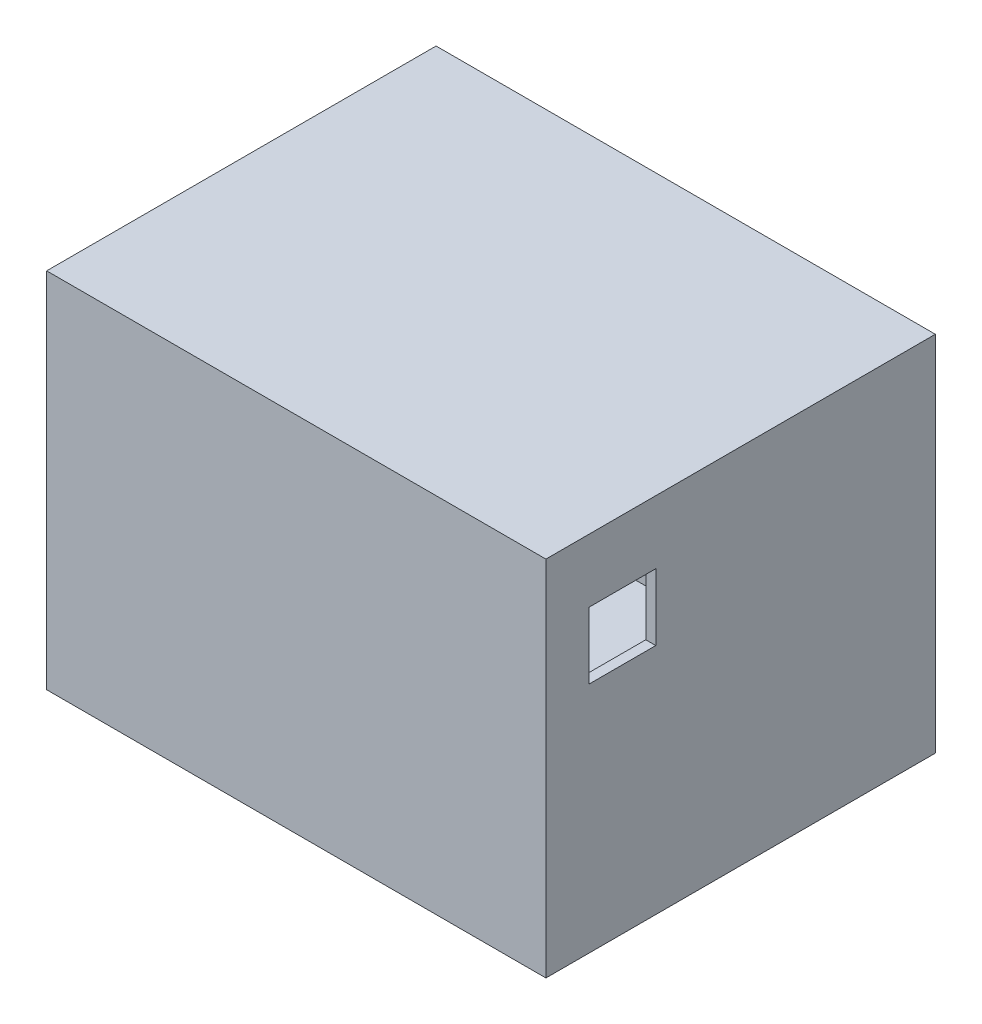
from build123d import *

# Parameters (mm, degrees)
SKETCH1_W           = 3657.6
SKETCH1_H           = 2819.4
BOSS_EXTRUDE1_DEPTH = 76.2
SKETCH2_W           = 3810
SKETCH2_H           = 2971.8
SKETCH2_W_2         = 3657.6
SKETCH2_H_2         = 2819.4
BOSS_EXTRUDE2_DEPTH = 2692.4
SKETCH4_W           = 508
SKETCH4_H           = 508
CUT_EXTRUDE2_DEPTH  = 76.2
SKETCH5_W           = 990.6
SKETCH5_H           = 1739.9
SKETCH5_W_2         = 762
SKETCH5_H_2         = 1524
BOSS_EXTRUDE3_DEPTH = 25.4
SKETCH6_W           = 762
SKETCH6_H           = 1524
CUT_EXTRUDE3_DEPTH  = 5408.443617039
SKETCH7_W           = 762
SKETCH7_H           = 2032
CUT_EXTRUDE4_DEPTH  = 100
SKETCH8_W           = 3810
SKETCH8_H           = 2971.8
BOSS_EXTRUDE4_DEPTH = 76.2


with BuildPart() as part:
    # Sketch1 → Boss-Extrude1 (new body)
    with BuildSketch(Plane(origin=(0, 0, 0), x_dir=(1, 0, 0), z_dir=(0, 1, 0))):
        with Locations((1736.841850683, -1351.381493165)):
            Rectangle(SKETCH1_W, SKETCH1_H)
    extrude(amount=BOSS_EXTRUDE1_DEPTH)


with BuildPart() as body_2:
    # Sketch2 → Boss-Extrude2 (new body)
    with BuildSketch(Plane(origin=(0, 0, 0), x_dir=(1, 0, 0), z_dir=(0, 1, 0))):
        with Locations((1736.841850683, -1351.381493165)):
            Rectangle(SKETCH2_W, SKETCH2_H)
        with Locations((1736.841850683, -1351.381493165)):
            Rectangle(SKETCH2_W_2, SKETCH2_H_2, mode=Mode.SUBTRACT)
    extrude(amount=BOSS_EXTRUDE2_DEPTH)

    # Sketch4 → Cut-Extrude2 (cut)
    with BuildSketch(Plane(origin=(3641.841850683, 0, 0), x_dir=(0, 0, -1), z_dir=(1, 0, 0))):
        with Locations((-2253.081493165, 2032)):
            Rectangle(SKETCH4_W, SKETCH4_H)
    extrude(amount=-CUT_EXTRUDE2_DEPTH, mode=Mode.SUBTRACT)

    # Sketch6 → Cut-Extrude3 (cut, through all)
    with BuildSketch(Plane(origin=(-91.958149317, 0, 0), x_dir=(0, 0, -1), z_dir=(1, 0, 0))):
        with Locations((-1351.381493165, 1435.1)):
            Rectangle(SKETCH6_W, SKETCH6_H)
    extrude(amount=-CUT_EXTRUDE3_DEPTH, mode=Mode.SUBTRACT)

    # Sketch7 → Cut-Extrude4 (cut)
    with BuildSketch(Plane.XY.offset(-58.318506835)):
        with Locations((2060.691850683, 1092.2)):
            Rectangle(SKETCH7_W, SKETCH7_H)
    extrude(amount=-CUT_EXTRUDE4_DEPTH, mode=Mode.SUBTRACT)

    # Sketch8 → Boss-Extrude4 (add)
    with BuildSketch(Plane(origin=(0, 2692.4, 0), x_dir=(1, 0, 0), z_dir=(0, 1, 0))):
        with Locations((1736.841850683, -1351.381493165)):
            Rectangle(SKETCH8_W, SKETCH8_H)
    extrude(amount=BOSS_EXTRUDE4_DEPTH)


with BuildPart() as body_3:
    # Sketch5 → Boss-Extrude3 (new body)
    with BuildSketch(Plane(origin=(-91.958149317, 0, 0), x_dir=(0, 0, -1), z_dir=(1, 0, 0))):
        with Locations((-1351.381493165, 1454.15)):
            Rectangle(SKETCH5_W, SKETCH5_H)
        with Locations((-1351.381493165, 1435.1)):
            Rectangle(SKETCH5_W_2, SKETCH5_H_2, mode=Mode.SUBTRACT)
    extrude(amount=BOSS_EXTRUDE3_DEPTH)


solid = Compound([part.part, body_2.part, body_3.part])
